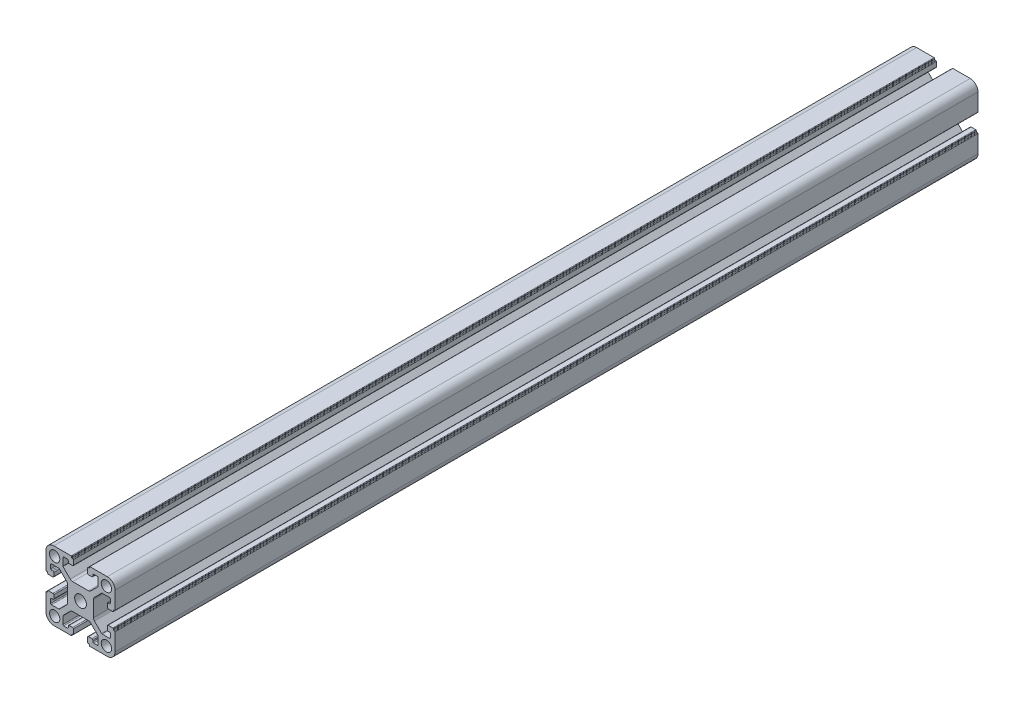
from build123d import *

# Parameters (mm, degrees)
MODEL_R         = 3.4
MODEL_R_2       = 3
EXTRUDE_1_DEPTH = 500


with BuildPart() as part:
    # Model → Extrude 1 (new body)
    with BuildSketch(Plane.XY):
        with BuildLine():
            Line((2122.488929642, 1192.840021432), (2122.488929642, 1192.440021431))
            ThreePointArc((2122.488929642, 1192.440021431), (2122.576797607, 1192.227889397), (2122.788929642, 1192.140021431))
            Line((2122.788929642, 1192.140021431), (2123.188929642, 1192.140021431))
            ThreePointArc((2123.188929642, 1192.140021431), (2123.401061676, 1192.052153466), (2123.488929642, 1191.840021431))
            Line((2123.488929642, 1191.840021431), (2123.488929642, 1181.740021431))
            ThreePointArc((2123.488929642, 1181.740021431), (2122.170910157, 1178.558040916), (2118.988929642, 1177.240021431))
            Line((2118.988929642, 1177.240021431), (2108.888929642, 1177.240021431))
            ThreePointArc((2108.888929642, 1177.240021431), (2108.676797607, 1177.327889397), (2108.588929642, 1177.540021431))
            Line((2108.588929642, 1177.540021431), (2108.588929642, 1177.940021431))
            ThreePointArc((2108.588929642, 1177.940021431), (2108.501061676, 1178.152153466), (2108.288929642, 1178.240021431))
            Line((2108.288929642, 1178.240021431), (2107.888929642, 1178.240021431))
            ThreePointArc((2107.888929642, 1178.240021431), (2107.676797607, 1178.327889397), (2107.588929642, 1178.540021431))
            Line((2107.588929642, 1178.540021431), (2107.588929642, 1181.24002149))
            ThreePointArc((2107.588929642, 1181.24002149), (2107.735376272, 1181.593574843), (2108.088929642, 1181.740021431))
            Line((2108.088929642, 1181.740021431), (2110.088929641, 1181.740021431))
            ThreePointArc((2110.088929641, 1181.740021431), (2110.442483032, 1181.593574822), (2110.588929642, 1181.240021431))
            Line((2110.588929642, 1181.240021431), (2110.588929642, 1180.440021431))
            ThreePointArc((2110.588929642, 1180.440021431), (2110.735376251, 1180.086468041), (2111.088929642, 1179.940021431))
            Line((2111.088929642, 1179.940021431), (2113.238929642, 1179.940021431))
            ThreePointArc((2113.238929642, 1179.940021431), (2113.592483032, 1180.086468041), (2113.738929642, 1180.440021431))
            Line((2113.738929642, 1180.440021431), (2113.738929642, 1184.661594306))
            ThreePointArc((2113.738929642, 1184.661594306), (2113.700869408, 1184.852936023), (2113.592483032, 1185.015147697))
            Line((2113.592483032, 1185.015147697), (2109.453395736, 1189.154234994))
            ThreePointArc((2109.453395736, 1189.154234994), (2108.804549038, 1189.587780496), (2108.039182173, 1189.740021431))
            Line((2108.039182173, 1189.740021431), (2098.93867711, 1189.740021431))
            ThreePointArc((2098.93867711, 1189.740021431), (2098.173310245, 1189.587780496), (2097.524463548, 1189.154234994))
            Line((2097.524463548, 1189.154234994), (2093.385376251, 1185.015147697))
            ThreePointArc((2093.385376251, 1185.015147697), (2093.276989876, 1184.852936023), (2093.238929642, 1184.661594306))
            Line((2093.238929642, 1184.661594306), (2093.238929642, 1180.440021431))
            ThreePointArc((2093.238929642, 1180.440021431), (2093.385376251, 1180.086468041), (2093.738929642, 1179.940021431))
            Line((2093.738929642, 1179.940021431), (2095.888929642, 1179.940021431))
            ThreePointArc((2095.888929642, 1179.940021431), (2096.242483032, 1180.086468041), (2096.388929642, 1180.440021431))
            Line((2096.388929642, 1180.440021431), (2096.388929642, 1181.240021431))
            ThreePointArc((2096.388929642, 1181.240021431), (2096.535376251, 1181.593574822), (2096.888929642, 1181.740021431))
            Line((2096.888929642, 1181.740021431), (2098.888929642, 1181.740021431))
            ThreePointArc((2098.888929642, 1181.740021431), (2099.242483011, 1181.593574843), (2099.388929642, 1181.24002149))
            Line((2099.388929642, 1181.24002149), (2099.388929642, 1178.540021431))
            ThreePointArc((2099.388929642, 1178.540021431), (2099.301061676, 1178.327889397), (2099.088929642, 1178.240021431))
            Line((2099.088929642, 1178.240021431), (2098.688929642, 1178.240021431))
            ThreePointArc((2098.688929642, 1178.240021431), (2098.476797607, 1178.152153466), (2098.388929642, 1177.940021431))
            Line((2098.388929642, 1177.940021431), (2098.388929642, 1177.540021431))
            ThreePointArc((2098.388929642, 1177.540021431), (2098.301061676, 1177.327889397), (2098.088929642, 1177.240021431))
            Line((2098.088929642, 1177.240021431), (2087.988929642, 1177.240021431))
            ThreePointArc((2087.988929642, 1177.240021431), (2084.806949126, 1178.558040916), (2083.488929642, 1181.740021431))
            Line((2083.488929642, 1181.740021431), (2083.488929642, 1191.840021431))
            ThreePointArc((2083.488929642, 1191.840021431), (2083.576797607, 1192.052153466), (2083.788929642, 1192.140021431))
            Line((2083.788929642, 1192.140021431), (2084.188929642, 1192.140021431))
            ThreePointArc((2084.188929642, 1192.140021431), (2084.401061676, 1192.227889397), (2084.488929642, 1192.440021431))
            Line((2084.488929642, 1192.440021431), (2084.488929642, 1192.840021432))
            ThreePointArc((2084.488929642, 1192.840021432), (2084.576797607, 1193.052153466), (2084.788929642, 1193.140021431))
            Line((2084.788929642, 1193.140021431), (2087.488929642, 1193.140021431))
            ThreePointArc((2087.488929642, 1193.140021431), (2087.842483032, 1192.993574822), (2087.988929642, 1192.640021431))
            Line((2087.988929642, 1192.640021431), (2087.988929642, 1190.640021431))
            ThreePointArc((2087.988929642, 1190.640021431), (2087.842483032, 1190.286468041), (2087.488929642, 1190.140021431))
            Line((2087.488929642, 1190.140021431), (2086.688929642, 1190.140021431))
            ThreePointArc((2086.688929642, 1190.140021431), (2086.335376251, 1189.993574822), (2086.188929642, 1189.640021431))
            Line((2086.188929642, 1189.640021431), (2086.188929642, 1187.490021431))
            ThreePointArc((2086.188929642, 1187.490021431), (2086.335376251, 1187.136468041), (2086.688929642, 1186.990021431))
            Line((2086.688929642, 1186.990021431), (2090.910502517, 1186.990021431))
            ThreePointArc((2090.910502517, 1186.990021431), (2091.101844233, 1187.028081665), (2091.264055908, 1187.136468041))
            Line((2091.264055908, 1187.136468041), (2095.403143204, 1191.275555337))
            ThreePointArc((2095.403143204, 1191.275555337), (2095.836688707, 1191.924402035), (2095.988929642, 1192.6897689))
            Line((2095.988929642, 1192.6897689), (2095.988929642, 1201.790273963))
            ThreePointArc((2095.988929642, 1201.790273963), (2095.836688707, 1202.555640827), (2095.403143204, 1203.204487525))
            Line((2095.403143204, 1203.204487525), (2091.264055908, 1207.343574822))
            ThreePointArc((2091.264055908, 1207.343574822), (2091.101844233, 1207.451961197), (2090.910502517, 1207.490021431))
            Line((2090.910502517, 1207.490021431), (2086.688929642, 1207.490021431))
            ThreePointArc((2086.688929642, 1207.490021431), (2086.335376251, 1207.343574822), (2086.188929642, 1206.990021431))
            Line((2086.188929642, 1206.990021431), (2086.188929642, 1204.840021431))
            ThreePointArc((2086.188929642, 1204.840021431), (2086.335376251, 1204.48646804), (2086.688929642, 1204.340021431))
            Line((2086.688929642, 1204.340021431), (2087.488929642, 1204.340021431))
            ThreePointArc((2087.488929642, 1204.340021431), (2087.842483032, 1204.193574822), (2087.988929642, 1203.840021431))
            Line((2087.988929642, 1203.840021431), (2087.988929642, 1201.840021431))
            ThreePointArc((2087.988929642, 1201.840021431), (2087.842483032, 1201.48646804), (2087.488929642, 1201.340021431))
            Line((2087.488929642, 1201.340021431), (2084.788929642, 1201.340021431))
            ThreePointArc((2084.788929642, 1201.340021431), (2084.576797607, 1201.427889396), (2084.488929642, 1201.640021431))
            Line((2084.488929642, 1201.640021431), (2084.488929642, 1202.040021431))
            ThreePointArc((2084.488929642, 1202.040021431), (2084.401061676, 1202.252153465), (2084.188929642, 1202.340021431))
            Line((2084.188929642, 1202.340021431), (2083.788929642, 1202.340021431))
            ThreePointArc((2083.788929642, 1202.340021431), (2083.576797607, 1202.427889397), (2083.488929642, 1202.640021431))
            Line((2083.488929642, 1202.640021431), (2083.488929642, 1212.740021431))
            ThreePointArc((2083.488929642, 1212.740021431), (2084.806949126, 1215.922001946), (2087.988929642, 1217.240021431))
            Line((2087.988929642, 1217.240021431), (2098.088929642, 1217.240021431))
            ThreePointArc((2098.088929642, 1217.240021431), (2098.301061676, 1217.152153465), (2098.388929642, 1216.940021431))
            Line((2098.388929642, 1216.940021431), (2098.388929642, 1216.540021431))
            ThreePointArc((2098.388929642, 1216.540021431), (2098.476797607, 1216.327889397), (2098.688929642, 1216.240021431))
            Line((2098.688929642, 1216.240021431), (2099.088929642, 1216.240021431))
            ThreePointArc((2099.088929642, 1216.240021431), (2099.301061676, 1216.152153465), (2099.388929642, 1215.940021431))
            Line((2099.388929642, 1215.940021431), (2099.388929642, 1213.240021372))
            ThreePointArc((2099.388929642, 1213.240021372), (2099.242483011, 1212.88646802), (2098.888929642, 1212.740021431))
            Line((2098.888929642, 1212.740021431), (2096.888929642, 1212.740021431))
            ThreePointArc((2096.888929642, 1212.740021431), (2096.535376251, 1212.88646804), (2096.388929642, 1213.240021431))
            Line((2096.388929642, 1213.240021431), (2096.388929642, 1214.040021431))
            ThreePointArc((2096.388929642, 1214.040021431), (2096.242483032, 1214.393574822), (2095.888929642, 1214.540021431))
            Line((2095.888929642, 1214.540021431), (2093.738929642, 1214.540021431))
            ThreePointArc((2093.738929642, 1214.540021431), (2093.385376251, 1214.393574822), (2093.238929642, 1214.040021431))
            Line((2093.238929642, 1214.040021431), (2093.238929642, 1209.818448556))
            ThreePointArc((2093.238929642, 1209.818448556), (2093.276989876, 1209.62710684), (2093.385376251, 1209.464895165))
            Line((2093.385376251, 1209.464895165), (2097.524463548, 1205.325807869))
            ThreePointArc((2097.524463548, 1205.325807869), (2098.173310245, 1204.892262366), (2098.93867711, 1204.740021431))
            Line((2098.93867711, 1204.740021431), (2108.039182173, 1204.740021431))
            ThreePointArc((2108.039182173, 1204.740021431), (2108.804549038, 1204.892262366), (2109.453395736, 1205.325807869))
            Line((2109.453395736, 1205.325807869), (2113.592483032, 1209.464895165))
            ThreePointArc((2113.592483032, 1209.464895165), (2113.700869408, 1209.62710684), (2113.738929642, 1209.818448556))
            Line((2113.738929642, 1209.818448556), (2113.738929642, 1214.040021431))
            ThreePointArc((2113.738929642, 1214.040021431), (2113.592483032, 1214.393574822), (2113.238929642, 1214.540021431))
            Line((2113.238929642, 1214.540021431), (2111.088929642, 1214.540021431))
            ThreePointArc((2111.088929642, 1214.540021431), (2110.735376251, 1214.393574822), (2110.588929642, 1214.040021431))
            Line((2110.588929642, 1214.040021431), (2110.588929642, 1213.240021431))
            ThreePointArc((2110.588929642, 1213.240021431), (2110.442483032, 1212.88646804), (2110.088929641, 1212.740021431))
            Line((2110.088929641, 1212.740021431), (2108.088929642, 1212.740021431))
            ThreePointArc((2108.088929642, 1212.740021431), (2107.735376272, 1212.88646802), (2107.588929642, 1213.240021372))
            Line((2107.588929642, 1213.240021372), (2107.588929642, 1215.940021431))
            ThreePointArc((2107.588929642, 1215.940021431), (2107.676797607, 1216.152153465), (2107.888929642, 1216.240021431))
            Line((2107.888929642, 1216.240021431), (2108.288929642, 1216.240021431))
            ThreePointArc((2108.288929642, 1216.240021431), (2108.501061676, 1216.327889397), (2108.588929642, 1216.540021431))
            Line((2108.588929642, 1216.540021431), (2108.588929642, 1216.940021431))
            ThreePointArc((2108.588929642, 1216.940021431), (2108.676797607, 1217.152153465), (2108.888929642, 1217.240021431))
            Line((2108.888929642, 1217.240021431), (2118.988929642, 1217.240021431))
            ThreePointArc((2118.988929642, 1217.240021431), (2122.170910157, 1215.922001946), (2123.488929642, 1212.740021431))
            Line((2123.488929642, 1212.740021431), (2123.488929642, 1202.640021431))
            ThreePointArc((2123.488929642, 1202.640021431), (2123.401061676, 1202.427889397), (2123.188929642, 1202.340021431))
            Line((2123.188929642, 1202.340021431), (2122.788929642, 1202.340021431))
            ThreePointArc((2122.788929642, 1202.340021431), (2122.576797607, 1202.252153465), (2122.488929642, 1202.040021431))
            Line((2122.488929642, 1202.040021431), (2122.488929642, 1201.640021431))
            ThreePointArc((2122.488929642, 1201.640021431), (2122.401061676, 1201.427889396), (2122.188929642, 1201.340021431))
            Line((2122.188929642, 1201.340021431), (2119.488929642, 1201.340021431))
            ThreePointArc((2119.488929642, 1201.340021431), (2119.135376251, 1201.48646804), (2118.988929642, 1201.840021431))
            Line((2118.988929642, 1201.840021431), (2118.988929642, 1203.840021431))
            ThreePointArc((2118.988929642, 1203.840021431), (2119.135376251, 1204.193574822), (2119.488929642, 1204.340021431))
            Line((2119.488929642, 1204.340021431), (2120.288929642, 1204.340021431))
            ThreePointArc((2120.288929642, 1204.340021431), (2120.642483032, 1204.48646804), (2120.788929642, 1204.840021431))
            Line((2120.788929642, 1204.840021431), (2120.788929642, 1206.990021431))
            ThreePointArc((2120.788929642, 1206.990021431), (2120.642483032, 1207.343574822), (2120.288929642, 1207.490021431))
            Line((2120.288929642, 1207.490021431), (2116.067356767, 1207.490021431))
            ThreePointArc((2116.067356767, 1207.490021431), (2115.87601505, 1207.451961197), (2115.713803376, 1207.343574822))
            Line((2115.713803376, 1207.343574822), (2111.574716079, 1203.204487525))
            ThreePointArc((2111.574716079, 1203.204487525), (2111.141170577, 1202.555640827), (2110.988929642, 1201.790273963))
            Line((2110.988929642, 1201.790273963), (2110.988929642, 1192.6897689))
            ThreePointArc((2110.988929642, 1192.6897689), (2111.141170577, 1191.924402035), (2111.574716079, 1191.275555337))
            Line((2111.574716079, 1191.275555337), (2115.713803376, 1187.136468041))
            ThreePointArc((2115.713803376, 1187.136468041), (2115.87601505, 1187.028081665), (2116.067356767, 1186.990021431))
            Line((2116.067356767, 1186.990021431), (2120.288929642, 1186.990021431))
            ThreePointArc((2120.288929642, 1186.990021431), (2120.642483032, 1187.136468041), (2120.788929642, 1187.490021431))
            Line((2120.788929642, 1187.490021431), (2120.788929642, 1189.640021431))
            ThreePointArc((2120.788929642, 1189.640021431), (2120.642483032, 1189.993574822), (2120.288929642, 1190.140021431))
            Line((2120.288929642, 1190.140021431), (2119.488929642, 1190.140021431))
            ThreePointArc((2119.488929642, 1190.140021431), (2119.135376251, 1190.286468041), (2118.988929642, 1190.640021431))
            Line((2118.988929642, 1190.640021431), (2118.988929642, 1192.640021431))
            ThreePointArc((2118.988929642, 1192.640021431), (2119.135376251, 1192.993574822), (2119.488929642, 1193.140021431))
            Line((2119.488929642, 1193.140021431), (2122.188929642, 1193.140021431))
            ThreePointArc((2122.188929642, 1193.140021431), (2122.401061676, 1193.052153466), (2122.488929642, 1192.840021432))
        make_face()
        with Locations((2103.488929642, 1197.240021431)):
            Circle(MODEL_R, mode=Mode.SUBTRACT)
        with Locations((2118.488929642, 1212.240021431)):
            Circle(MODEL_R_2, mode=Mode.SUBTRACT)
        with Locations((2088.488929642, 1212.240021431)):
            Circle(MODEL_R_2, mode=Mode.SUBTRACT)
        with Locations((2088.488929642, 1182.240021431)):
            Circle(MODEL_R_2, mode=Mode.SUBTRACT)
        with Locations((2118.488929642, 1182.240021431)):
            Circle(MODEL_R_2, mode=Mode.SUBTRACT)
    extrude(amount=EXTRUDE_1_DEPTH)


solid = part.part
